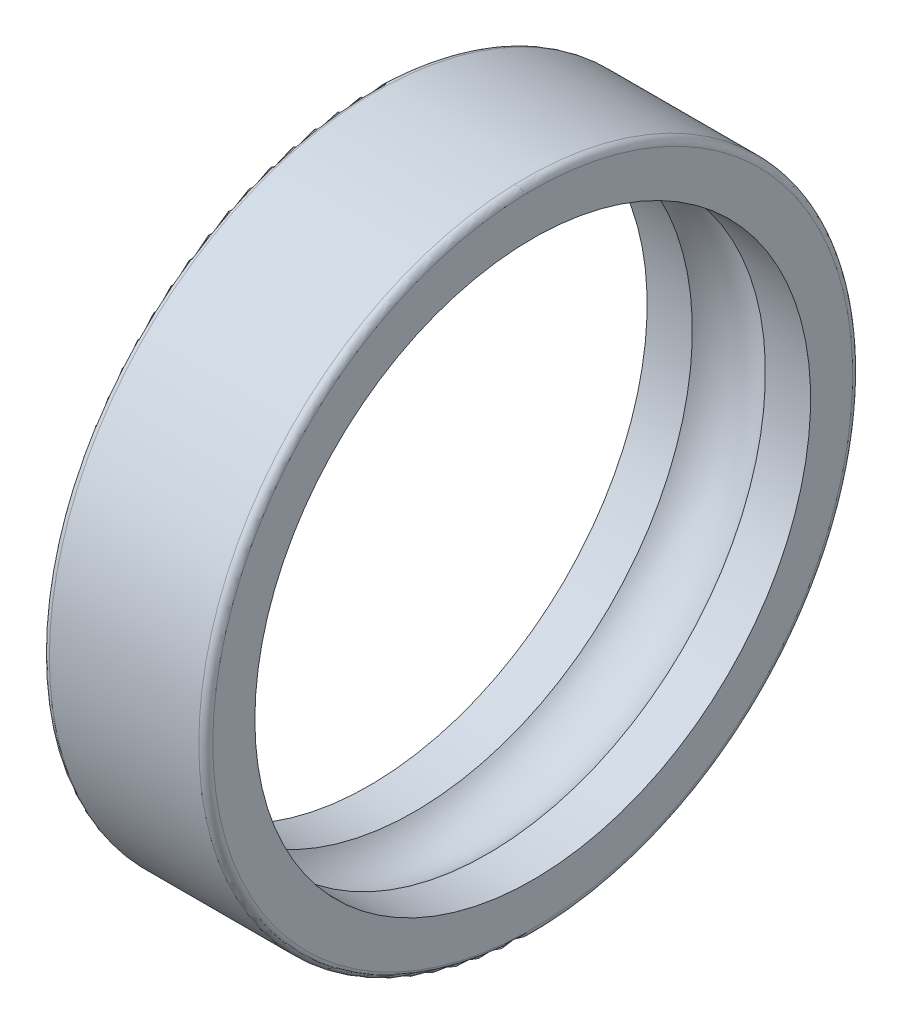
from build123d import *


with BuildPart() as part:
    # Esquisse1 → Base-R_volution (revolve)
    with BuildSketch(Plane(origin=(0, 0, 0), x_dir=(1, 0, 0), z_dir=(0, 1, 0)), mode=Mode.PRIVATE) as base_r_volution_sk:
        with BuildLine():
            Line((0, 6.85), (0, 5.95))
            Line((0, 5.95), (0.967376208, 5.95))
            ThreePointArc((0.967376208, 5.95), (1.75, 6.3), (2.532623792, 5.95))
            Line((2.532623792, 5.95), (3.5, 5.95))
            Line((3.5, 5.95), (3.5, 6.85))
            ThreePointArc((3.5, 6.85), (3.456066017, 6.956066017), (3.35, 7))
            Line((3.35, 7), (0.15, 7))
            ThreePointArc((0.15, 7), (0.043933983, 6.956066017), (0, 6.85))
        make_face()
    revolve(base_r_volution_sk.sketch.rotate(Axis((0, 0, 0), (1, 0, 0)), 180), axis=Axis((0, 0, 0), (1, 0, 0)))


solid = part.part
